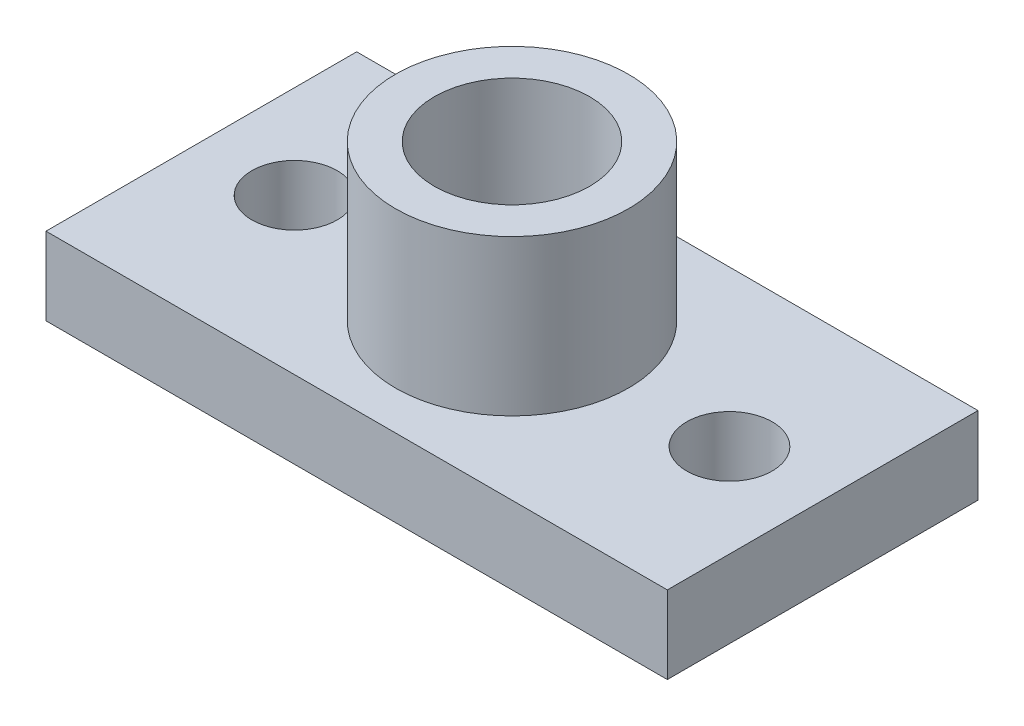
from build123d import *

# Parameters (mm, degrees)
ESQUISSE1_W             = 80
ESQUISSE1_H             = 40
BOSS_EXTRU_1_DEPTH      = 10
ESQUISSE2_R             = 15
BOSS_EXTRU_2_DEPTH      = 20
ESQUISSE3_R             = 10
ENL_V_MAT_EXTRU_1_DEPTH = 45
ESQUISSE4_R             = 5.5
ENL_V_MAT_EXTRU_2_DEPTH = 45


with BuildPart() as part:
    # Esquisse1 → Boss.-Extru.1 (new body)
    with BuildSketch(Plane(origin=(0, 0, 0), x_dir=(1, 0, 0), z_dir=(0, 1, 0))):
        Rectangle(ESQUISSE1_W, ESQUISSE1_H)
    extrude(amount=BOSS_EXTRU_1_DEPTH)

    # Esquisse2 → Boss.-Extru.2 (add)
    with BuildSketch(Plane(origin=(0, 10, 0), x_dir=(1, 0, 0), z_dir=(0, 1, 0))):
        with Locations(Location((0, 0, 0), (0, 0, 270))):
            Circle(ESQUISSE2_R)
    extrude(amount=BOSS_EXTRU_2_DEPTH)

    # Esquisse3 → Enl_v. mat.-Extru.1 (cut)
    with BuildSketch(Plane(origin=(0, 30, 0), x_dir=(1, 0, 0), z_dir=(0, 1, 0))):
        with Locations(Location((0, 0, 0), (0, 0, 270))):
            Circle(ESQUISSE3_R)
    extrude(amount=-ENL_V_MAT_EXTRU_1_DEPTH, mode=Mode.SUBTRACT)

    # Esquisse4 → Enl_v. mat.-Extru.2 (cut)
    with BuildSketch(Plane(origin=(0, 10, 0), x_dir=(1, 0, 0), z_dir=(0, 1, 0))):
        with Locations(Location((-28, 0, 0), (0, 0, 270))):
            Circle(ESQUISSE4_R)
        with Locations(Location((28, 0, 0), (0, 0, 270))):
            Circle(ESQUISSE4_R)
    extrude(amount=-ENL_V_MAT_EXTRU_2_DEPTH, mode=Mode.SUBTRACT)


solid = part.part
